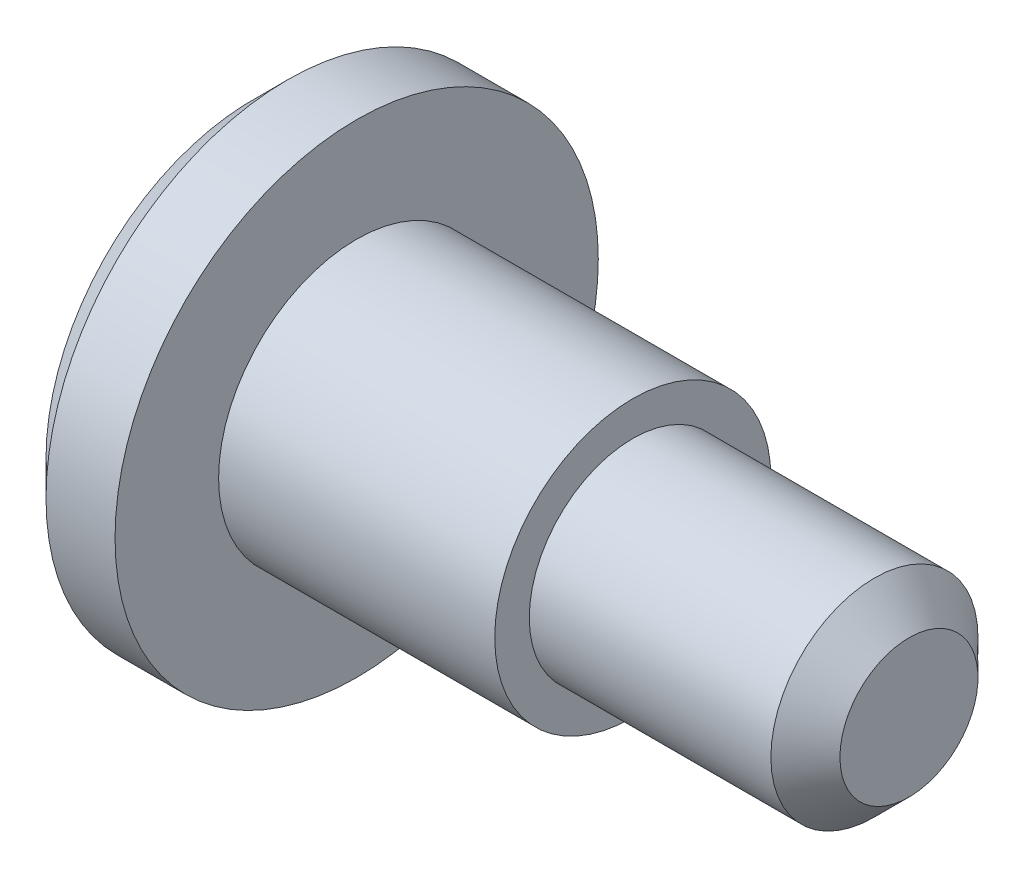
ISO-10303-21;
HEADER;
FILE_DESCRIPTION(('STEP AP214'),'2;1');
FILE_NAME('part.step','',(''),(''),'','','');
FILE_SCHEMA(('AUTOMOTIVE_DESIGN { 1 0 10303 214 1 1 1 1 }'));
ENDSEC;
DATA;
#1=APPLICATION_CONTEXT('core data for automotive mechanical design processes');
#2=APPLICATION_PROTOCOL_DEFINITION('international standard','automotive_design',2000,#1);
#3=PRODUCT_CONTEXT('',#1,'mechanical');
#4=PRODUCT('Part','Part','',(#3));
#5=PRODUCT_RELATED_PRODUCT_CATEGORY('part','',(#4));
#6=PRODUCT_DEFINITION_FORMATION('','',#4);
#7=PRODUCT_DEFINITION_CONTEXT('part definition',#1,'design');
#8=PRODUCT_DEFINITION('design','',#6,#7);
#9=PRODUCT_DEFINITION_SHAPE('','',#8);
#10=(LENGTH_UNIT() NAMED_UNIT(*) SI_UNIT(.MILLI.,.METRE.));
#11=(NAMED_UNIT(*) PLANE_ANGLE_UNIT() SI_UNIT($,.RADIAN.));
#12=(NAMED_UNIT(*) SI_UNIT($,.STERADIAN.) SOLID_ANGLE_UNIT());
#13=UNCERTAINTY_MEASURE_WITH_UNIT(LENGTH_MEASURE(1.E-05),#10,'distance_accuracy_value','');
#14=(GEOMETRIC_REPRESENTATION_CONTEXT(3) GLOBAL_UNCERTAINTY_ASSIGNED_CONTEXT((#13)) GLOBAL_UNIT_ASSIGNED_CONTEXT((#10,
#11,#12)) REPRESENTATION_CONTEXT('',''));
#15=CARTESIAN_POINT('',(0.,0.,0.));
#16=DIRECTION('',(0.,0.,1.));
#17=DIRECTION('',(1.,0.,0.));
#18=AXIS2_PLACEMENT_3D('',#15,#16,#17);
#19=CARTESIAN_POINT('',(-1.5,0.,0.));
#20=DIRECTION('',(1.,0.,0.));
#21=DIRECTION('',(0.,0.,-1.));
#22=AXIS2_PLACEMENT_3D('',#19,#20,#21);
#23=PLANE('',#22);
#24=CARTESIAN_POINT('',(-1.5,0.,0.));
#25=DIRECTION('',(1.,0.,0.));
#26=DIRECTION('',(0.,0.,-1.));
#27=AXIS2_PLACEMENT_3D('',#24,#25,#26);
#28=CIRCLE('',#27,3.);
#29=CARTESIAN_POINT('',(-1.5,0.,-3.));
#30=VERTEX_POINT('',#29);
#31=EDGE_CURVE('E38',#30,#30,#28,.F.);
#32=ORIENTED_EDGE('',*,*,#31,.T.);
#33=EDGE_LOOP('',(#32));
#34=FACE_BOUND('',#33,.T.);
#35=ADVANCED_FACE('F31',(#34),#23,.F.);
#36=CARTESIAN_POINT('',(-3.00095238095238,0.,0.));
#37=DIRECTION('',(-1.,0.,0.));
#38=DIRECTION('',(0.,0.,1.));
#39=AXIS2_PLACEMENT_3D('',#36,#37,#38);
#40=CYLINDRICAL_SURFACE('',#39,3.5);
#41=CARTESIAN_POINT('',(-0.999999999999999,0.,0.));
#42=DIRECTION('',(1.,0.,0.));
#43=DIRECTION('',(0.,0.,-1.));
#44=AXIS2_PLACEMENT_3D('',#41,#42,#43);
#45=CIRCLE('',#44,3.5);
#46=CARTESIAN_POINT('',(-0.999999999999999,0.,-3.5));
#47=VERTEX_POINT('',#46);
#48=EDGE_CURVE('E10',#47,#47,#45,.T.);
#49=ORIENTED_EDGE('',*,*,#48,.T.);
#50=EDGE_LOOP('',(#49));
#51=FACE_BOUND('',#50,.T.);
#52=CARTESIAN_POINT('',(0.,0.,0.));
#53=DIRECTION('',(-1.,0.,0.));
#54=DIRECTION('',(0.,0.,1.));
#55=AXIS2_PLACEMENT_3D('',#52,#53,#54);
#56=CIRCLE('',#55,3.5);
#57=CARTESIAN_POINT('',(0.,0.,3.5));
#58=VERTEX_POINT('',#57);
#59=EDGE_CURVE('E51',#58,#58,#56,.T.);
#60=ORIENTED_EDGE('',*,*,#59,.T.);
#61=EDGE_LOOP('',(#60));
#62=FACE_BOUND('',#61,.T.);
#63=ADVANCED_FACE('F82',(#51,#62),#40,.T.);
#64=CARTESIAN_POINT('',(0.,3.5,0.));
#65=DIRECTION('',(-1.,0.,0.));
#66=DIRECTION('',(0.,0.,1.));
#67=AXIS2_PLACEMENT_3D('',#64,#65,#66);
#68=PLANE('',#67);
#69=ORIENTED_EDGE('',*,*,#59,.F.);
#70=EDGE_LOOP('',(#69));
#71=FACE_BOUND('',#70,.T.);
#72=CARTESIAN_POINT('',(0.,0.,0.));
#73=DIRECTION('',(-1.,0.,0.));
#74=DIRECTION('',(0.,0.,1.));
#75=AXIS2_PLACEMENT_3D('',#72,#73,#74);
#76=CIRCLE('',#75,2.);
#77=CARTESIAN_POINT('',(0.,0.,2.));
#78=VERTEX_POINT('',#77);
#79=EDGE_CURVE('E54',#78,#78,#76,.T.);
#80=ORIENTED_EDGE('',*,*,#79,.T.);
#81=EDGE_LOOP('',(#80));
#82=FACE_BOUND('',#81,.T.);
#83=ADVANCED_FACE('F87',(#71,#82),#68,.F.);
#84=CARTESIAN_POINT('',(-3.00095238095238,0.,0.));
#85=DIRECTION('',(-1.,0.,0.));
#86=DIRECTION('',(0.,0.,1.));
#87=AXIS2_PLACEMENT_3D('',#84,#85,#86);
#88=CYLINDRICAL_SURFACE('',#87,2.);
#89=ORIENTED_EDGE('',*,*,#79,.F.);
#90=EDGE_LOOP('',(#89));
#91=FACE_BOUND('',#90,.T.);
#92=CARTESIAN_POINT('',(4.,0.,0.));
#93=DIRECTION('',(-1.,0.,0.));
#94=DIRECTION('',(0.,0.,1.));
#95=AXIS2_PLACEMENT_3D('',#92,#93,#94);
#96=CIRCLE('',#95,2.);
#97=CARTESIAN_POINT('',(4.,0.,2.));
#98=VERTEX_POINT('',#97);
#99=EDGE_CURVE('E57',#98,#98,#96,.T.);
#100=ORIENTED_EDGE('',*,*,#99,.T.);
#101=EDGE_LOOP('',(#100));
#102=FACE_BOUND('',#101,.T.);
#103=ADVANCED_FACE('F78',(#91,#102),#88,.T.);
#104=CARTESIAN_POINT('',(4.,2.,0.));
#105=DIRECTION('',(-1.,0.,0.));
#106=DIRECTION('',(0.,0.,1.));
#107=AXIS2_PLACEMENT_3D('',#104,#105,#106);
#108=PLANE('',#107);
#109=ORIENTED_EDGE('',*,*,#99,.F.);
#110=EDGE_LOOP('',(#109));
#111=FACE_BOUND('',#110,.T.);
#112=CARTESIAN_POINT('',(4.,0.,0.));
#113=DIRECTION('',(-1.,0.,0.));
#114=DIRECTION('',(0.,0.,1.));
#115=AXIS2_PLACEMENT_3D('',#112,#113,#114);
#116=CIRCLE('',#115,1.5);
#117=CARTESIAN_POINT('',(4.,0.,1.5));
#118=VERTEX_POINT('',#117);
#119=EDGE_CURVE('E60',#118,#118,#116,.T.);
#120=ORIENTED_EDGE('',*,*,#119,.T.);
#121=EDGE_LOOP('',(#120));
#122=FACE_BOUND('',#121,.T.);
#123=ADVANCED_FACE('F64',(#111,#122),#108,.F.);
#124=CARTESIAN_POINT('',(-3.00095238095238,0.,0.));
#125=DIRECTION('',(-1.,0.,0.));
#126=DIRECTION('',(0.,0.,1.));
#127=AXIS2_PLACEMENT_3D('',#124,#125,#126);
#128=CYLINDRICAL_SURFACE('',#127,1.5);
#129=CARTESIAN_POINT('',(7.5,0.,0.));
#130=DIRECTION('',(-1.,0.,0.));
#131=DIRECTION('',(0.,0.,1.));
#132=AXIS2_PLACEMENT_3D('',#129,#130,#131);
#133=CIRCLE('',#132,1.5);
#134=CARTESIAN_POINT('',(7.5,0.,1.5));
#135=VERTEX_POINT('',#134);
#136=EDGE_CURVE('E46',#135,#135,#133,.T.);
#137=ORIENTED_EDGE('',*,*,#136,.T.);
#138=EDGE_LOOP('',(#137));
#139=FACE_BOUND('',#138,.T.);
#140=ORIENTED_EDGE('',*,*,#119,.F.);
#141=EDGE_LOOP('',(#140));
#142=FACE_BOUND('',#141,.T.);
#143=ADVANCED_FACE('F66',(#139,#142),#128,.T.);
#144=CARTESIAN_POINT('',(8.,1.5,0.));
#145=DIRECTION('',(-1.,0.,0.));
#146=DIRECTION('',(0.,0.,1.));
#147=AXIS2_PLACEMENT_3D('',#144,#145,#146);
#148=PLANE('',#147);
#149=CARTESIAN_POINT('',(8.,0.,0.));
#150=DIRECTION('',(-1.,0.,0.));
#151=DIRECTION('',(0.,0.,1.));
#152=AXIS2_PLACEMENT_3D('',#149,#150,#151);
#153=CIRCLE('',#152,0.999999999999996);
#154=CARTESIAN_POINT('',(8.,0.,0.999999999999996));
#155=VERTEX_POINT('',#154);
#156=EDGE_CURVE('E42',#155,#155,#153,.F.);
#157=ORIENTED_EDGE('',*,*,#156,.T.);
#158=EDGE_LOOP('',(#157));
#159=FACE_BOUND('',#158,.T.);
#160=ADVANCED_FACE('F68',(#159),#148,.F.);
#161=CARTESIAN_POINT('',(7.5,0.,0.));
#162=DIRECTION('',(-1.,0.,0.));
#163=DIRECTION('',(0.,0.,1.));
#164=AXIS2_PLACEMENT_3D('',#161,#162,#163);
#165=CONICAL_SURFACE('',#164,1.5,0.785398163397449);
#166=ORIENTED_EDGE('',*,*,#156,.F.);
#167=EDGE_LOOP('',(#166));
#168=FACE_BOUND('',#167,.T.);
#169=ORIENTED_EDGE('',*,*,#136,.F.);
#170=EDGE_LOOP('',(#169));
#171=FACE_BOUND('',#170,.T.);
#172=ADVANCED_FACE('F75',(#168,#171),#165,.T.);
#173=CARTESIAN_POINT('',(-1.5,0.,0.));
#174=DIRECTION('',(1.,0.,0.));
#175=DIRECTION('',(0.,0.,-1.));
#176=AXIS2_PLACEMENT_3D('',#173,#174,#175);
#177=CONICAL_SURFACE('',#176,3.,0.785398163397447);
#178=ORIENTED_EDGE('',*,*,#48,.F.);
#179=EDGE_LOOP('',(#178));
#180=FACE_BOUND('',#179,.T.);
#181=ORIENTED_EDGE('',*,*,#31,.F.);
#182=EDGE_LOOP('',(#181));
#183=FACE_BOUND('',#182,.T.);
#184=ADVANCED_FACE('F33',(#180,#183),#177,.T.);
#185=CLOSED_SHELL('',(#35,#63,#83,#103,#123,#143,#160,#172,#184));
#186=MANIFOLD_SOLID_BREP('B2',#185);
#187=ADVANCED_BREP_SHAPE_REPRESENTATION('',(#18,#186),#14);
#188=SHAPE_DEFINITION_REPRESENTATION(#9,#187);
ENDSEC;
END-ISO-10303-21;
